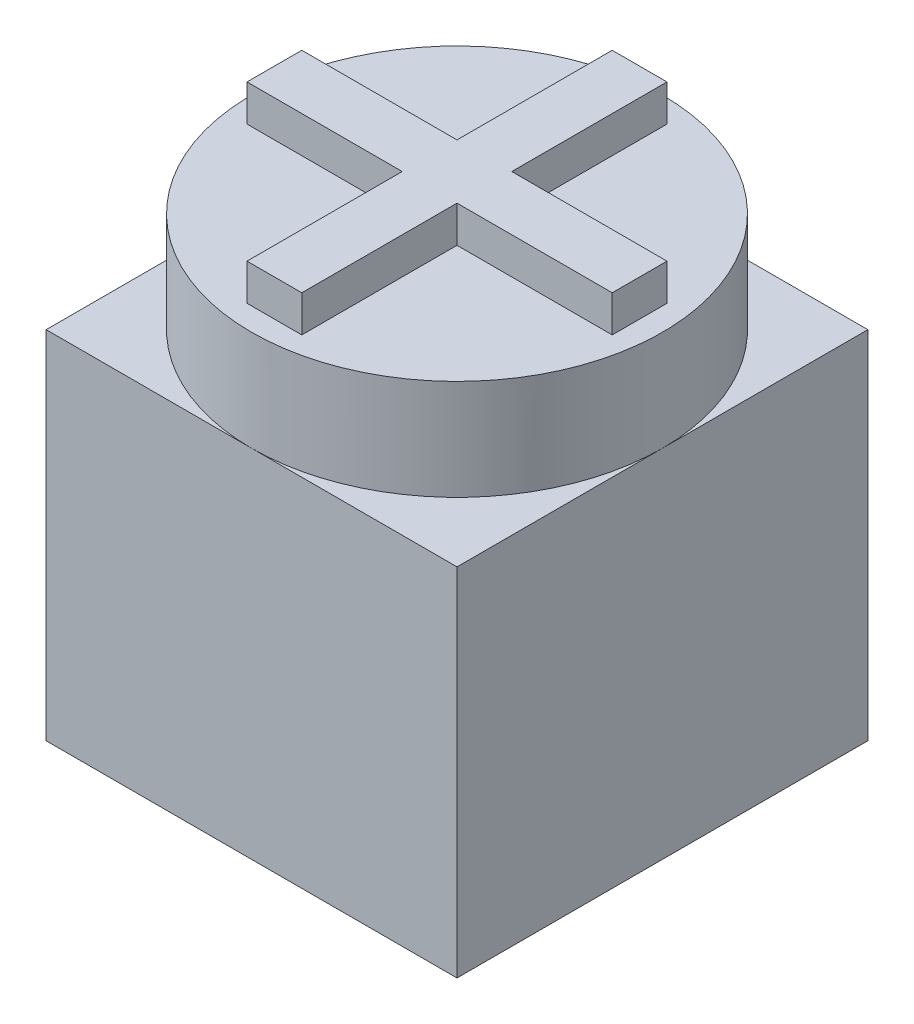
ISO-10303-21;
HEADER;
FILE_DESCRIPTION(('STEP AP214'),'2;1');
FILE_NAME('part.step','',(''),(''),'','','');
FILE_SCHEMA(('AUTOMOTIVE_DESIGN { 1 0 10303 214 1 1 1 1 }'));
ENDSEC;
DATA;
#1=APPLICATION_CONTEXT('core data for automotive mechanical design processes');
#2=APPLICATION_PROTOCOL_DEFINITION('international standard','automotive_design',2000,#1);
#3=PRODUCT_CONTEXT('',#1,'mechanical');
#4=PRODUCT('Part','Part','',(#3));
#5=PRODUCT_RELATED_PRODUCT_CATEGORY('part','',(#4));
#6=PRODUCT_DEFINITION_FORMATION('','',#4);
#7=PRODUCT_DEFINITION_CONTEXT('part definition',#1,'design');
#8=PRODUCT_DEFINITION('design','',#6,#7);
#9=PRODUCT_DEFINITION_SHAPE('','',#8);
#10=(LENGTH_UNIT() NAMED_UNIT(*) SI_UNIT(.MILLI.,.METRE.));
#11=(NAMED_UNIT(*) PLANE_ANGLE_UNIT() SI_UNIT($,.RADIAN.));
#12=(NAMED_UNIT(*) SI_UNIT($,.STERADIAN.) SOLID_ANGLE_UNIT());
#13=UNCERTAINTY_MEASURE_WITH_UNIT(LENGTH_MEASURE(1.E-05),#10,'distance_accuracy_value','');
#14=(GEOMETRIC_REPRESENTATION_CONTEXT(3) GLOBAL_UNCERTAINTY_ASSIGNED_CONTEXT((#13)) GLOBAL_UNIT_ASSIGNED_CONTEXT((#10,
#11,#12)) REPRESENTATION_CONTEXT('',''));
#15=CARTESIAN_POINT('',(0.,0.,0.));
#16=DIRECTION('',(0.,0.,1.));
#17=DIRECTION('',(1.,0.,0.));
#18=AXIS2_PLACEMENT_3D('',#15,#16,#17);
#19=CARTESIAN_POINT('',(0.,7.8,0.));
#20=DIRECTION('',(0.,1.,0.));
#21=DIRECTION('',(0.,0.,1.));
#22=AXIS2_PLACEMENT_3D('',#19,#20,#21);
#23=PLANE('',#22);
#24=CARTESIAN_POINT('',(0.,7.8,0.));
#25=DIRECTION('',(0.,1.,0.));
#26=DIRECTION('',(0.,0.,1.));
#27=AXIS2_PLACEMENT_3D('',#24,#25,#26);
#28=CIRCLE('',#27,4.5);
#29=CARTESIAN_POINT('',(0.,7.8,4.5));
#30=VERTEX_POINT('',#29);
#31=CARTESIAN_POINT('',(4.5,7.8,0.));
#32=VERTEX_POINT('',#31);
#33=EDGE_CURVE('E48',#30,#32,#28,.T.);
#34=ORIENTED_EDGE('',*,*,#33,.F.);
#35=DIRECTION('',(1.,0.,0.));
#36=VECTOR('',#35,1.);
#37=CARTESIAN_POINT('',(-4.5,7.8,4.5));
#38=LINE('',#37,#36);
#39=CARTESIAN_POINT('',(4.5,7.8,4.5));
#40=VERTEX_POINT('',#39);
#41=EDGE_CURVE('E208',#30,#40,#38,.T.);
#42=ORIENTED_EDGE('',*,*,#41,.T.);
#43=DIRECTION('',(0.,0.,-1.));
#44=VECTOR('',#43,1.);
#45=CARTESIAN_POINT('',(4.5,7.8,-4.5));
#46=LINE('',#45,#44);
#47=EDGE_CURVE('E196',#40,#32,#46,.T.);
#48=ORIENTED_EDGE('',*,*,#47,.T.);
#49=EDGE_LOOP('',(#34,#42,#48));
#50=FACE_BOUND('',#49,.T.);
#51=ADVANCED_FACE('F37',(#50),#23,.T.);
#52=CARTESIAN_POINT('',(0.,7.8,-4.5));
#53=VERTEX_POINT('',#52);
#54=EDGE_CURVE('E11',#32,#53,#28,.T.);
#55=ORIENTED_EDGE('',*,*,#54,.F.);
#56=CARTESIAN_POINT('',(4.5,7.8,-4.5));
#57=VERTEX_POINT('',#56);
#58=EDGE_CURVE('E200',#32,#57,#46,.T.);
#59=ORIENTED_EDGE('',*,*,#58,.T.);
#60=DIRECTION('',(-1.,0.,0.));
#61=VECTOR('',#60,1.);
#62=CARTESIAN_POINT('',(-4.5,7.8,-4.5));
#63=LINE('',#62,#61);
#64=EDGE_CURVE('E201',#57,#53,#63,.T.);
#65=ORIENTED_EDGE('',*,*,#64,.T.);
#66=EDGE_LOOP('',(#55,#59,#65));
#67=FACE_BOUND('',#66,.T.);
#68=ADVANCED_FACE('F243',(#67),#23,.T.);
#69=CARTESIAN_POINT('',(-4.5,7.8,0.));
#70=VERTEX_POINT('',#69);
#71=EDGE_CURVE('E46',#53,#70,#28,.T.);
#72=ORIENTED_EDGE('',*,*,#71,.F.);
#73=CARTESIAN_POINT('',(-4.5,7.8,-4.5));
#74=VERTEX_POINT('',#73);
#75=EDGE_CURVE('E199',#53,#74,#63,.T.);
#76=ORIENTED_EDGE('',*,*,#75,.T.);
#77=DIRECTION('',(0.,0.,1.));
#78=VECTOR('',#77,1.);
#79=CARTESIAN_POINT('',(-4.5,7.8,-4.5));
#80=LINE('',#79,#78);
#81=EDGE_CURVE('E205',#74,#70,#80,.T.);
#82=ORIENTED_EDGE('',*,*,#81,.T.);
#83=EDGE_LOOP('',(#72,#76,#82));
#84=FACE_BOUND('',#83,.T.);
#85=ADVANCED_FACE('F240',(#84),#23,.T.);
#86=CARTESIAN_POINT('',(4.5,7.8,-4.5));
#87=DIRECTION('',(-1.,0.,0.));
#88=DIRECTION('',(0.,0.,1.));
#89=AXIS2_PLACEMENT_3D('',#86,#87,#88);
#90=PLANE('',#89);
#91=DIRECTION('',(0.,0.,-1.));
#92=VECTOR('',#91,1.);
#93=CARTESIAN_POINT('',(4.5,0.,-4.5));
#94=LINE('',#93,#92);
#95=CARTESIAN_POINT('',(4.5,0.,4.5));
#96=VERTEX_POINT('',#95);
#97=CARTESIAN_POINT('',(4.5,0.,-4.5));
#98=VERTEX_POINT('',#97);
#99=EDGE_CURVE('E194',#96,#98,#94,.T.);
#100=ORIENTED_EDGE('',*,*,#99,.T.);
#101=DIRECTION('',(0.,-1.,0.));
#102=VECTOR('',#101,1.);
#103=CARTESIAN_POINT('',(4.5,7.8,-4.5));
#104=LINE('',#103,#102);
#105=EDGE_CURVE('E41',#57,#98,#104,.T.);
#106=ORIENTED_EDGE('',*,*,#105,.F.);
#107=ORIENTED_EDGE('',*,*,#58,.F.);
#108=ORIENTED_EDGE('',*,*,#47,.F.);
#109=DIRECTION('',(0.,-1.,0.));
#110=VECTOR('',#109,1.);
#111=CARTESIAN_POINT('',(4.5,7.8,4.5));
#112=LINE('',#111,#110);
#113=EDGE_CURVE('E211',#40,#96,#112,.T.);
#114=ORIENTED_EDGE('',*,*,#113,.T.);
#115=EDGE_LOOP('',(#100,#106,#107,#108,#114));
#116=FACE_BOUND('',#115,.T.);
#117=ADVANCED_FACE('F39',(#116),#90,.F.);
#118=CARTESIAN_POINT('',(-4.5,7.8,-4.5));
#119=DIRECTION('',(0.,0.,1.));
#120=DIRECTION('',(1.,0.,0.));
#121=AXIS2_PLACEMENT_3D('',#118,#119,#120);
#122=PLANE('',#121);
#123=DIRECTION('',(-1.,0.,0.));
#124=VECTOR('',#123,1.);
#125=CARTESIAN_POINT('',(-4.5,0.,-4.5));
#126=LINE('',#125,#124);
#127=CARTESIAN_POINT('',(-4.5,0.,-4.5));
#128=VERTEX_POINT('',#127);
#129=EDGE_CURVE('E214',#98,#128,#126,.T.);
#130=ORIENTED_EDGE('',*,*,#129,.T.);
#131=DIRECTION('',(0.,-1.,0.));
#132=VECTOR('',#131,1.);
#133=CARTESIAN_POINT('',(-4.5,7.8,-4.5));
#134=LINE('',#133,#132);
#135=EDGE_CURVE('E224',#74,#128,#134,.T.);
#136=ORIENTED_EDGE('',*,*,#135,.F.);
#137=ORIENTED_EDGE('',*,*,#75,.F.);
#138=ORIENTED_EDGE('',*,*,#64,.F.);
#139=ORIENTED_EDGE('',*,*,#105,.T.);
#140=EDGE_LOOP('',(#130,#136,#137,#138,#139));
#141=FACE_BOUND('',#140,.T.);
#142=ADVANCED_FACE('F241',(#141),#122,.F.);
#143=CARTESIAN_POINT('',(-4.5,7.8,-4.5));
#144=DIRECTION('',(1.,0.,0.));
#145=DIRECTION('',(0.,0.,-1.));
#146=AXIS2_PLACEMENT_3D('',#143,#144,#145);
#147=PLANE('',#146);
#148=DIRECTION('',(0.,0.,1.));
#149=VECTOR('',#148,1.);
#150=CARTESIAN_POINT('',(-4.5,0.,-4.5));
#151=LINE('',#150,#149);
#152=CARTESIAN_POINT('',(-4.5,0.,4.5));
#153=VERTEX_POINT('',#152);
#154=EDGE_CURVE('E216',#128,#153,#151,.T.);
#155=ORIENTED_EDGE('',*,*,#154,.T.);
#156=DIRECTION('',(0.,-1.,0.));
#157=VECTOR('',#156,1.);
#158=CARTESIAN_POINT('',(-4.5,7.8,4.5));
#159=LINE('',#158,#157);
#160=CARTESIAN_POINT('',(-4.5,7.8,4.5));
#161=VERTEX_POINT('',#160);
#162=EDGE_CURVE('E222',#161,#153,#159,.T.);
#163=ORIENTED_EDGE('',*,*,#162,.F.);
#164=EDGE_CURVE('E204',#70,#161,#80,.T.);
#165=ORIENTED_EDGE('',*,*,#164,.F.);
#166=ORIENTED_EDGE('',*,*,#81,.F.);
#167=ORIENTED_EDGE('',*,*,#135,.T.);
#168=EDGE_LOOP('',(#155,#163,#165,#166,#167));
#169=FACE_BOUND('',#168,.T.);
#170=ADVANCED_FACE('F259',(#169),#147,.F.);
#171=CARTESIAN_POINT('',(-4.5,7.8,4.5));
#172=DIRECTION('',(0.,0.,-1.));
#173=DIRECTION('',(-1.,0.,0.));
#174=AXIS2_PLACEMENT_3D('',#171,#172,#173);
#175=PLANE('',#174);
#176=DIRECTION('',(1.,0.,0.));
#177=VECTOR('',#176,1.);
#178=CARTESIAN_POINT('',(-4.5,0.,4.5));
#179=LINE('',#178,#177);
#180=EDGE_CURVE('E218',#153,#96,#179,.T.);
#181=ORIENTED_EDGE('',*,*,#180,.T.);
#182=ORIENTED_EDGE('',*,*,#113,.F.);
#183=ORIENTED_EDGE('',*,*,#41,.F.);
#184=EDGE_CURVE('E209',#161,#30,#38,.T.);
#185=ORIENTED_EDGE('',*,*,#184,.F.);
#186=ORIENTED_EDGE('',*,*,#162,.T.);
#187=EDGE_LOOP('',(#181,#182,#183,#185,#186));
#188=FACE_BOUND('',#187,.T.);
#189=ADVANCED_FACE('F253',(#188),#175,.F.);
#190=EDGE_CURVE('E188',#70,#30,#28,.T.);
#191=ORIENTED_EDGE('',*,*,#190,.F.);
#192=ORIENTED_EDGE('',*,*,#164,.T.);
#193=ORIENTED_EDGE('',*,*,#184,.T.);
#194=EDGE_LOOP('',(#191,#192,#193));
#195=FACE_BOUND('',#194,.T.);
#196=ADVANCED_FACE('F262',(#195),#23,.T.);
#197=CARTESIAN_POINT('',(0.,0.,0.));
#198=DIRECTION('',(0.,1.,0.));
#199=DIRECTION('',(0.,0.,1.));
#200=AXIS2_PLACEMENT_3D('',#197,#198,#199);
#201=PLANE('',#200);
#202=ORIENTED_EDGE('',*,*,#99,.F.);
#203=ORIENTED_EDGE('',*,*,#180,.F.);
#204=ORIENTED_EDGE('',*,*,#154,.F.);
#205=ORIENTED_EDGE('',*,*,#129,.F.);
#206=EDGE_LOOP('',(#202,#203,#204,#205));
#207=FACE_BOUND('',#206,.T.);
#208=ADVANCED_FACE('F257',(#207),#201,.F.);
#209=CARTESIAN_POINT('',(0.,10.,0.));
#210=DIRECTION('',(0.,-1.,0.));
#211=DIRECTION('',(0.,0.,-1.));
#212=AXIS2_PLACEMENT_3D('',#209,#210,#211);
#213=CYLINDRICAL_SURFACE('',#212,4.5);
#214=CARTESIAN_POINT('',(0.,10.,0.));
#215=DIRECTION('',(0.,1.,0.));
#216=DIRECTION('',(0.,0.,1.));
#217=AXIS2_PLACEMENT_3D('',#214,#215,#216);
#218=CIRCLE('',#217,4.5);
#219=CARTESIAN_POINT('',(0.,10.,4.5));
#220=VERTEX_POINT('',#219);
#221=EDGE_CURVE('E187',#220,#220,#218,.T.);
#222=ORIENTED_EDGE('',*,*,#221,.F.);
#223=EDGE_LOOP('',(#222));
#224=FACE_BOUND('',#223,.T.);
#225=ORIENTED_EDGE('',*,*,#33,.T.);
#226=ORIENTED_EDGE('',*,*,#54,.T.);
#227=ORIENTED_EDGE('',*,*,#71,.T.);
#228=ORIENTED_EDGE('',*,*,#190,.T.);
#229=EDGE_LOOP('',(#225,#226,#227,#228));
#230=FACE_BOUND('',#229,.T.);
#231=ADVANCED_FACE('F237',(#224,#230),#213,.T.);
#232=CARTESIAN_POINT('',(0.,10.,0.));
#233=DIRECTION('',(0.,1.,0.));
#234=DIRECTION('',(0.,0.,1.));
#235=AXIS2_PLACEMENT_3D('',#232,#233,#234);
#236=PLANE('',#235);
#237=DIRECTION('',(0.,0.,1.));
#238=VECTOR('',#237,1.);
#239=CARTESIAN_POINT('',(-4.,10.,0.));
#240=LINE('',#239,#238);
#241=CARTESIAN_POINT('',(-4.,10.,-0.6));
#242=VERTEX_POINT('',#241);
#243=CARTESIAN_POINT('',(-4.,10.,0.6));
#244=VERTEX_POINT('',#243);
#245=EDGE_CURVE('E55',#242,#244,#240,.T.);
#246=ORIENTED_EDGE('',*,*,#245,.F.);
#247=DIRECTION('',(1.,0.,0.));
#248=VECTOR('',#247,1.);
#249=CARTESIAN_POINT('',(0.,10.,-0.6));
#250=LINE('',#249,#248);
#251=CARTESIAN_POINT('',(-0.6,10.,-0.6));
#252=VERTEX_POINT('',#251);
#253=EDGE_CURVE('E60',#242,#252,#250,.T.);
#254=ORIENTED_EDGE('',*,*,#253,.T.);
#255=DIRECTION('',(0.,0.,1.));
#256=VECTOR('',#255,1.);
#257=CARTESIAN_POINT('',(-0.6,10.,0.));
#258=LINE('',#257,#256);
#259=CARTESIAN_POINT('',(-0.600000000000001,10.,-4.));
#260=VERTEX_POINT('',#259);
#261=EDGE_CURVE('E450',#260,#252,#258,.T.);
#262=ORIENTED_EDGE('',*,*,#261,.F.);
#263=DIRECTION('',(1.,0.,0.));
#264=VECTOR('',#263,1.);
#265=CARTESIAN_POINT('',(0.,10.,-4.));
#266=LINE('',#265,#264);
#267=CARTESIAN_POINT('',(0.599999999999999,10.,-4.));
#268=VERTEX_POINT('',#267);
#269=EDGE_CURVE('E452',#260,#268,#266,.T.);
#270=ORIENTED_EDGE('',*,*,#269,.T.);
#271=DIRECTION('',(0.,0.,1.));
#272=VECTOR('',#271,1.);
#273=CARTESIAN_POINT('',(0.6,10.,0.));
#274=LINE('',#273,#272);
#275=CARTESIAN_POINT('',(0.6,10.,-0.6));
#276=VERTEX_POINT('',#275);
#277=EDGE_CURVE('E502',#268,#276,#274,.T.);
#278=ORIENTED_EDGE('',*,*,#277,.T.);
#279=DIRECTION('',(1.,0.,0.));
#280=VECTOR('',#279,1.);
#281=CARTESIAN_POINT('',(0.,10.,-0.6));
#282=LINE('',#281,#280);
#283=CARTESIAN_POINT('',(4.,10.,-0.6));
#284=VERTEX_POINT('',#283);
#285=EDGE_CURVE('E500',#276,#284,#282,.T.);
#286=ORIENTED_EDGE('',*,*,#285,.T.);
#287=DIRECTION('',(0.,0.,1.));
#288=VECTOR('',#287,1.);
#289=CARTESIAN_POINT('',(4.,10.,0.));
#290=LINE('',#289,#288);
#291=CARTESIAN_POINT('',(4.,10.,0.6));
#292=VERTEX_POINT('',#291);
#293=EDGE_CURVE('E498',#284,#292,#290,.T.);
#294=ORIENTED_EDGE('',*,*,#293,.T.);
#295=DIRECTION('',(1.,0.,0.));
#296=VECTOR('',#295,1.);
#297=CARTESIAN_POINT('',(0.,10.,0.6));
#298=LINE('',#297,#296);
#299=CARTESIAN_POINT('',(0.6,10.,0.6));
#300=VERTEX_POINT('',#299);
#301=EDGE_CURVE('E495',#300,#292,#298,.T.);
#302=ORIENTED_EDGE('',*,*,#301,.F.);
#303=DIRECTION('',(0.,0.,1.));
#304=VECTOR('',#303,1.);
#305=CARTESIAN_POINT('',(0.6,10.,0.));
#306=LINE('',#305,#304);
#307=CARTESIAN_POINT('',(0.6,10.,4.));
#308=VERTEX_POINT('',#307);
#309=EDGE_CURVE('E489',#300,#308,#306,.T.);
#310=ORIENTED_EDGE('',*,*,#309,.T.);
#311=DIRECTION('',(1.,0.,0.));
#312=VECTOR('',#311,1.);
#313=CARTESIAN_POINT('',(0.,10.,4.));
#314=LINE('',#313,#312);
#315=CARTESIAN_POINT('',(-0.6,10.,4.));
#316=VERTEX_POINT('',#315);
#317=EDGE_CURVE('E483',#316,#308,#314,.T.);
#318=ORIENTED_EDGE('',*,*,#317,.F.);
#319=DIRECTION('',(0.,0.,1.));
#320=VECTOR('',#319,1.);
#321=CARTESIAN_POINT('',(-0.6,10.,0.));
#322=LINE('',#321,#320);
#323=CARTESIAN_POINT('',(-0.6,10.,0.6));
#324=VERTEX_POINT('',#323);
#325=EDGE_CURVE('E486',#324,#316,#322,.T.);
#326=ORIENTED_EDGE('',*,*,#325,.F.);
#327=DIRECTION('',(1.,0.,0.));
#328=VECTOR('',#327,1.);
#329=CARTESIAN_POINT('',(0.,10.,0.6));
#330=LINE('',#329,#328);
#331=EDGE_CURVE('E487',#244,#324,#330,.T.);
#332=ORIENTED_EDGE('',*,*,#331,.F.);
#333=EDGE_LOOP('',(#246,#254,#262,#270,#278,#286,#294,#302,#310,#318,#326,#332));
#334=FACE_BOUND('',#333,.T.);
#335=ORIENTED_EDGE('',*,*,#221,.T.);
#336=EDGE_LOOP('',(#335));
#337=FACE_BOUND('',#336,.T.);
#338=ADVANCED_FACE('F301',(#334,#337),#236,.T.);
#339=CARTESIAN_POINT('',(-4.,10.8,0.));
#340=DIRECTION('',(1.,0.,0.));
#341=DIRECTION('',(0.,0.,-1.));
#342=AXIS2_PLACEMENT_3D('',#339,#340,#341);
#343=PLANE('',#342);
#344=ORIENTED_EDGE('',*,*,#245,.T.);
#345=DIRECTION('',(0.,-1.,0.));
#346=VECTOR('',#345,1.);
#347=CARTESIAN_POINT('',(-4.,10.8,0.6));
#348=LINE('',#347,#346);
#349=CARTESIAN_POINT('',(-4.,10.8,0.6));
#350=VERTEX_POINT('',#349);
#351=EDGE_CURVE('E169',#350,#244,#348,.T.);
#352=ORIENTED_EDGE('',*,*,#351,.F.);
#353=DIRECTION('',(0.,0.,1.));
#354=VECTOR('',#353,1.);
#355=CARTESIAN_POINT('',(-4.,10.8,0.));
#356=LINE('',#355,#354);
#357=CARTESIAN_POINT('',(-4.,10.8,-0.6));
#358=VERTEX_POINT('',#357);
#359=EDGE_CURVE('E175',#358,#350,#356,.T.);
#360=ORIENTED_EDGE('',*,*,#359,.F.);
#361=DIRECTION('',(0.,-1.,0.));
#362=VECTOR('',#361,1.);
#363=CARTESIAN_POINT('',(-4.,10.8,-0.6));
#364=LINE('',#363,#362);
#365=EDGE_CURVE('E446',#358,#242,#364,.T.);
#366=ORIENTED_EDGE('',*,*,#365,.T.);
#367=EDGE_LOOP('',(#344,#352,#360,#366));
#368=FACE_BOUND('',#367,.T.);
#369=ADVANCED_FACE('F184',(#368),#343,.F.);
#370=CARTESIAN_POINT('',(0.,10.8,0.6));
#371=DIRECTION('',(0.,0.,-1.));
#372=DIRECTION('',(-1.,0.,0.));
#373=AXIS2_PLACEMENT_3D('',#370,#371,#372);
#374=PLANE('',#373);
#375=ORIENTED_EDGE('',*,*,#331,.T.);
#376=DIRECTION('',(0.,-1.,0.));
#377=VECTOR('',#376,1.);
#378=CARTESIAN_POINT('',(-0.6,10.8,0.6));
#379=LINE('',#378,#377);
#380=CARTESIAN_POINT('',(-0.6,10.8,0.6));
#381=VERTEX_POINT('',#380);
#382=EDGE_CURVE('E171',#381,#324,#379,.T.);
#383=ORIENTED_EDGE('',*,*,#382,.F.);
#384=DIRECTION('',(1.,0.,0.));
#385=VECTOR('',#384,1.);
#386=CARTESIAN_POINT('',(0.,10.8,0.6));
#387=LINE('',#386,#385);
#388=EDGE_CURVE('E164',#350,#381,#387,.T.);
#389=ORIENTED_EDGE('',*,*,#388,.F.);
#390=ORIENTED_EDGE('',*,*,#351,.T.);
#391=EDGE_LOOP('',(#375,#383,#389,#390));
#392=FACE_BOUND('',#391,.T.);
#393=ADVANCED_FACE('F167',(#392),#374,.F.);
#394=CARTESIAN_POINT('',(-0.6,10.8,0.));
#395=DIRECTION('',(1.,0.,0.));
#396=DIRECTION('',(0.,0.,-1.));
#397=AXIS2_PLACEMENT_3D('',#394,#395,#396);
#398=PLANE('',#397);
#399=ORIENTED_EDGE('',*,*,#325,.T.);
#400=DIRECTION('',(0.,-1.,0.));
#401=VECTOR('',#400,1.);
#402=CARTESIAN_POINT('',(-0.6,10.8,4.));
#403=LINE('',#402,#401);
#404=CARTESIAN_POINT('',(-0.6,10.8,4.));
#405=VERTEX_POINT('',#404);
#406=EDGE_CURVE('E189',#405,#316,#403,.T.);
#407=ORIENTED_EDGE('',*,*,#406,.F.);
#408=DIRECTION('',(0.,0.,1.));
#409=VECTOR('',#408,1.);
#410=CARTESIAN_POINT('',(-0.6,10.8,0.));
#411=LINE('',#410,#409);
#412=EDGE_CURVE('E174',#381,#405,#411,.T.);
#413=ORIENTED_EDGE('',*,*,#412,.F.);
#414=ORIENTED_EDGE('',*,*,#382,.T.);
#415=EDGE_LOOP('',(#399,#407,#413,#414));
#416=FACE_BOUND('',#415,.T.);
#417=ADVANCED_FACE('F319',(#416),#398,.F.);
#418=CARTESIAN_POINT('',(0.,10.8,4.));
#419=DIRECTION('',(0.,0.,-1.));
#420=DIRECTION('',(-1.,0.,0.));
#421=AXIS2_PLACEMENT_3D('',#418,#419,#420);
#422=PLANE('',#421);
#423=ORIENTED_EDGE('',*,*,#317,.T.);
#424=DIRECTION('',(0.,-1.,0.));
#425=VECTOR('',#424,1.);
#426=CARTESIAN_POINT('',(0.6,10.8,4.));
#427=LINE('',#426,#425);
#428=CARTESIAN_POINT('',(0.6,10.8,4.));
#429=VERTEX_POINT('',#428);
#430=EDGE_CURVE('E476',#429,#308,#427,.T.);
#431=ORIENTED_EDGE('',*,*,#430,.F.);
#432=DIRECTION('',(1.,0.,0.));
#433=VECTOR('',#432,1.);
#434=CARTESIAN_POINT('',(0.,10.8,4.));
#435=LINE('',#434,#433);
#436=EDGE_CURVE('E484',#405,#429,#435,.T.);
#437=ORIENTED_EDGE('',*,*,#436,.F.);
#438=ORIENTED_EDGE('',*,*,#406,.T.);
#439=EDGE_LOOP('',(#423,#431,#437,#438));
#440=FACE_BOUND('',#439,.T.);
#441=ADVANCED_FACE('F326',(#440),#422,.F.);
#442=CARTESIAN_POINT('',(0.6,10.8,0.));
#443=DIRECTION('',(1.,0.,0.));
#444=DIRECTION('',(0.,0.,-1.));
#445=AXIS2_PLACEMENT_3D('',#442,#443,#444);
#446=PLANE('',#445);
#447=ORIENTED_EDGE('',*,*,#309,.F.);
#448=DIRECTION('',(0.,-1.,0.));
#449=VECTOR('',#448,1.);
#450=CARTESIAN_POINT('',(0.6,10.8,0.6));
#451=LINE('',#450,#449);
#452=CARTESIAN_POINT('',(0.6,10.8,0.6));
#453=VERTEX_POINT('',#452);
#454=EDGE_CURVE('E473',#453,#300,#451,.T.);
#455=ORIENTED_EDGE('',*,*,#454,.F.);
#456=DIRECTION('',(0.,0.,1.));
#457=VECTOR('',#456,1.);
#458=CARTESIAN_POINT('',(0.6,10.8,0.));
#459=LINE('',#458,#457);
#460=EDGE_CURVE('E525',#453,#429,#459,.T.);
#461=ORIENTED_EDGE('',*,*,#460,.T.);
#462=ORIENTED_EDGE('',*,*,#430,.T.);
#463=EDGE_LOOP('',(#447,#455,#461,#462));
#464=FACE_BOUND('',#463,.T.);
#465=ADVANCED_FACE('F334',(#464),#446,.T.);
#466=CARTESIAN_POINT('',(0.,10.8,0.6));
#467=DIRECTION('',(0.,0.,-1.));
#468=DIRECTION('',(-1.,0.,0.));
#469=AXIS2_PLACEMENT_3D('',#466,#467,#468);
#470=PLANE('',#469);
#471=ORIENTED_EDGE('',*,*,#301,.T.);
#472=DIRECTION('',(0.,-1.,0.));
#473=VECTOR('',#472,1.);
#474=CARTESIAN_POINT('',(4.,10.8,0.6));
#475=LINE('',#474,#473);
#476=CARTESIAN_POINT('',(4.,10.8,0.6));
#477=VERTEX_POINT('',#476);
#478=EDGE_CURVE('E470',#477,#292,#475,.T.);
#479=ORIENTED_EDGE('',*,*,#478,.F.);
#480=DIRECTION('',(1.,0.,0.));
#481=VECTOR('',#480,1.);
#482=CARTESIAN_POINT('',(0.,10.8,0.6));
#483=LINE('',#482,#481);
#484=EDGE_CURVE('E522',#453,#477,#483,.T.);
#485=ORIENTED_EDGE('',*,*,#484,.F.);
#486=ORIENTED_EDGE('',*,*,#454,.T.);
#487=EDGE_LOOP('',(#471,#479,#485,#486));
#488=FACE_BOUND('',#487,.T.);
#489=ADVANCED_FACE('F342',(#488),#470,.F.);
#490=CARTESIAN_POINT('',(4.,10.8,0.));
#491=DIRECTION('',(1.,0.,0.));
#492=DIRECTION('',(0.,0.,-1.));
#493=AXIS2_PLACEMENT_3D('',#490,#491,#492);
#494=PLANE('',#493);
#495=ORIENTED_EDGE('',*,*,#293,.F.);
#496=DIRECTION('',(0.,-1.,0.));
#497=VECTOR('',#496,1.);
#498=CARTESIAN_POINT('',(4.,10.8,-0.6));
#499=LINE('',#498,#497);
#500=CARTESIAN_POINT('',(4.,10.8,-0.6));
#501=VERTEX_POINT('',#500);
#502=EDGE_CURVE('E467',#501,#284,#499,.T.);
#503=ORIENTED_EDGE('',*,*,#502,.F.);
#504=DIRECTION('',(0.,0.,1.));
#505=VECTOR('',#504,1.);
#506=CARTESIAN_POINT('',(4.,10.8,0.));
#507=LINE('',#506,#505);
#508=EDGE_CURVE('E519',#501,#477,#507,.T.);
#509=ORIENTED_EDGE('',*,*,#508,.T.);
#510=ORIENTED_EDGE('',*,*,#478,.T.);
#511=EDGE_LOOP('',(#495,#503,#509,#510));
#512=FACE_BOUND('',#511,.T.);
#513=ADVANCED_FACE('F350',(#512),#494,.T.);
#514=CARTESIAN_POINT('',(0.,10.8,-0.6));
#515=DIRECTION('',(0.,0.,-1.));
#516=DIRECTION('',(-1.,0.,0.));
#517=AXIS2_PLACEMENT_3D('',#514,#515,#516);
#518=PLANE('',#517);
#519=ORIENTED_EDGE('',*,*,#285,.F.);
#520=DIRECTION('',(0.,-1.,0.));
#521=VECTOR('',#520,1.);
#522=CARTESIAN_POINT('',(0.6,10.8,-0.6));
#523=LINE('',#522,#521);
#524=CARTESIAN_POINT('',(0.6,10.8,-0.6));
#525=VERTEX_POINT('',#524);
#526=EDGE_CURVE('E464',#525,#276,#523,.T.);
#527=ORIENTED_EDGE('',*,*,#526,.F.);
#528=DIRECTION('',(1.,0.,0.));
#529=VECTOR('',#528,1.);
#530=CARTESIAN_POINT('',(0.,10.8,-0.6));
#531=LINE('',#530,#529);
#532=EDGE_CURVE('E532',#525,#501,#531,.T.);
#533=ORIENTED_EDGE('',*,*,#532,.T.);
#534=ORIENTED_EDGE('',*,*,#502,.T.);
#535=EDGE_LOOP('',(#519,#527,#533,#534));
#536=FACE_BOUND('',#535,.T.);
#537=ADVANCED_FACE('F358',(#536),#518,.T.);
#538=CARTESIAN_POINT('',(0.6,10.8,0.));
#539=DIRECTION('',(1.,0.,0.));
#540=DIRECTION('',(0.,0.,-1.));
#541=AXIS2_PLACEMENT_3D('',#538,#539,#540);
#542=PLANE('',#541);
#543=ORIENTED_EDGE('',*,*,#277,.F.);
#544=DIRECTION('',(0.,-1.,0.));
#545=VECTOR('',#544,1.);
#546=CARTESIAN_POINT('',(0.599999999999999,10.8,-4.));
#547=LINE('',#546,#545);
#548=CARTESIAN_POINT('',(0.599999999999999,10.8,-4.));
#549=VERTEX_POINT('',#548);
#550=EDGE_CURVE('E461',#549,#268,#547,.T.);
#551=ORIENTED_EDGE('',*,*,#550,.F.);
#552=DIRECTION('',(0.,0.,1.));
#553=VECTOR('',#552,1.);
#554=CARTESIAN_POINT('',(0.6,10.8,0.));
#555=LINE('',#554,#553);
#556=EDGE_CURVE('E512',#549,#525,#555,.T.);
#557=ORIENTED_EDGE('',*,*,#556,.T.);
#558=ORIENTED_EDGE('',*,*,#526,.T.);
#559=EDGE_LOOP('',(#543,#551,#557,#558));
#560=FACE_BOUND('',#559,.T.);
#561=ADVANCED_FACE('F366',(#560),#542,.T.);
#562=CARTESIAN_POINT('',(0.,10.8,-4.));
#563=DIRECTION('',(0.,0.,-1.));
#564=DIRECTION('',(-1.,0.,0.));
#565=AXIS2_PLACEMENT_3D('',#562,#563,#564);
#566=PLANE('',#565);
#567=ORIENTED_EDGE('',*,*,#269,.F.);
#568=DIRECTION('',(0.,-1.,0.));
#569=VECTOR('',#568,1.);
#570=CARTESIAN_POINT('',(-0.600000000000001,10.8,-4.));
#571=LINE('',#570,#569);
#572=CARTESIAN_POINT('',(-0.600000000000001,10.8,-4.));
#573=VERTEX_POINT('',#572);
#574=EDGE_CURVE('E458',#573,#260,#571,.T.);
#575=ORIENTED_EDGE('',*,*,#574,.F.);
#576=DIRECTION('',(1.,0.,0.));
#577=VECTOR('',#576,1.);
#578=CARTESIAN_POINT('',(0.,10.8,-4.));
#579=LINE('',#578,#577);
#580=EDGE_CURVE('E508',#573,#549,#579,.T.);
#581=ORIENTED_EDGE('',*,*,#580,.T.);
#582=ORIENTED_EDGE('',*,*,#550,.T.);
#583=EDGE_LOOP('',(#567,#575,#581,#582));
#584=FACE_BOUND('',#583,.T.);
#585=ADVANCED_FACE('F374',(#584),#566,.T.);
#586=CARTESIAN_POINT('',(-0.6,10.8,0.));
#587=DIRECTION('',(1.,0.,0.));
#588=DIRECTION('',(0.,0.,-1.));
#589=AXIS2_PLACEMENT_3D('',#586,#587,#588);
#590=PLANE('',#589);
#591=ORIENTED_EDGE('',*,*,#261,.T.);
#592=DIRECTION('',(0.,-1.,0.));
#593=VECTOR('',#592,1.);
#594=CARTESIAN_POINT('',(-0.6,10.8,-0.6));
#595=LINE('',#594,#593);
#596=CARTESIAN_POINT('',(-0.6,10.8,-0.6));
#597=VERTEX_POINT('',#596);
#598=EDGE_CURVE('E448',#597,#252,#595,.T.);
#599=ORIENTED_EDGE('',*,*,#598,.F.);
#600=DIRECTION('',(0.,0.,1.));
#601=VECTOR('',#600,1.);
#602=CARTESIAN_POINT('',(-0.6,10.8,0.));
#603=LINE('',#602,#601);
#604=EDGE_CURVE('E536',#573,#597,#603,.T.);
#605=ORIENTED_EDGE('',*,*,#604,.F.);
#606=ORIENTED_EDGE('',*,*,#574,.T.);
#607=EDGE_LOOP('',(#591,#599,#605,#606));
#608=FACE_BOUND('',#607,.T.);
#609=ADVANCED_FACE('F382',(#608),#590,.F.);
#610=CARTESIAN_POINT('',(0.,10.8,-0.6));
#611=DIRECTION('',(0.,0.,-1.));
#612=DIRECTION('',(-1.,0.,0.));
#613=AXIS2_PLACEMENT_3D('',#610,#611,#612);
#614=PLANE('',#613);
#615=ORIENTED_EDGE('',*,*,#253,.F.);
#616=ORIENTED_EDGE('',*,*,#365,.F.);
#617=DIRECTION('',(1.,0.,0.));
#618=VECTOR('',#617,1.);
#619=CARTESIAN_POINT('',(0.,10.8,-0.6));
#620=LINE('',#619,#618);
#621=EDGE_CURVE('E181',#358,#597,#620,.T.);
#622=ORIENTED_EDGE('',*,*,#621,.T.);
#623=ORIENTED_EDGE('',*,*,#598,.T.);
#624=EDGE_LOOP('',(#615,#616,#622,#623));
#625=FACE_BOUND('',#624,.T.);
#626=ADVANCED_FACE('F390',(#625),#614,.T.);
#627=CARTESIAN_POINT('',(0.,10.8,0.));
#628=DIRECTION('',(0.,1.,0.));
#629=DIRECTION('',(0.,0.,1.));
#630=AXIS2_PLACEMENT_3D('',#627,#628,#629);
#631=PLANE('',#630);
#632=ORIENTED_EDGE('',*,*,#359,.T.);
#633=ORIENTED_EDGE('',*,*,#388,.T.);
#634=ORIENTED_EDGE('',*,*,#412,.T.);
#635=ORIENTED_EDGE('',*,*,#436,.T.);
#636=ORIENTED_EDGE('',*,*,#460,.F.);
#637=ORIENTED_EDGE('',*,*,#484,.T.);
#638=ORIENTED_EDGE('',*,*,#508,.F.);
#639=ORIENTED_EDGE('',*,*,#532,.F.);
#640=ORIENTED_EDGE('',*,*,#556,.F.);
#641=ORIENTED_EDGE('',*,*,#580,.F.);
#642=ORIENTED_EDGE('',*,*,#604,.T.);
#643=ORIENTED_EDGE('',*,*,#621,.F.);
#644=EDGE_LOOP('',(#632,#633,#634,#635,#636,#637,#638,#639,#640,#641,#642,#643));
#645=FACE_BOUND('',#644,.T.);
#646=ADVANCED_FACE('F179',(#645),#631,.T.);
#647=CLOSED_SHELL('',(#51,#68,#85,#117,#142,#170,#189,#196,#208,#231,#338,#369,#393,#417,#441,
#465,#489,#513,#537,#561,#585,#609,#626,#646));
#648=MANIFOLD_SOLID_BREP('B2',#647);
#649=ADVANCED_BREP_SHAPE_REPRESENTATION('',(#18,#648),#14);
#650=SHAPE_DEFINITION_REPRESENTATION(#9,#649);
ENDSEC;
END-ISO-10303-21;
